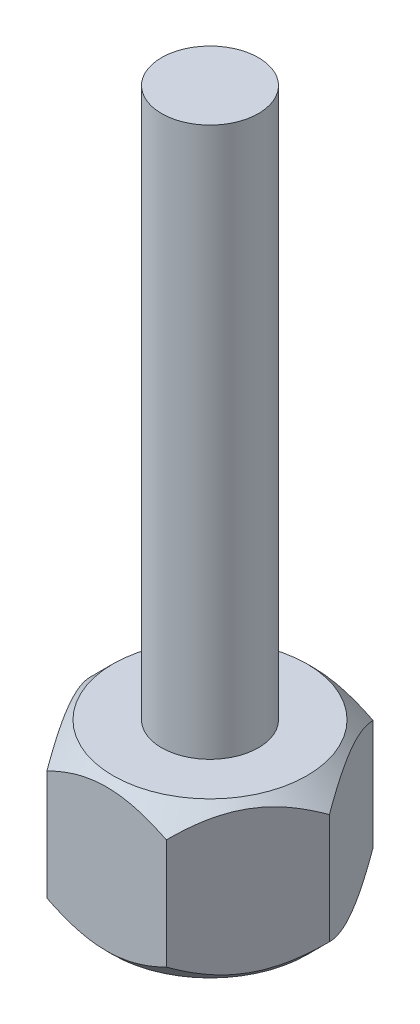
from build123d import *

# Parameters (mm, degrees)
BOSS_EXTRUDE1_DEPTH = 3
SKETCH2_OUTSIDE_W   = 25.96
SKETCH2_OUTSIDE_H   = 24.722
SKETCH2_OUTSIDE_R   = 3.75
CUT_EXTRUDE1_DEPTH  = 6
CUT_EXTRUDE1_DRAFT  = -45
SKETCH3_OUTSIDE_W   = 25.96
SKETCH3_OUTSIDE_H   = 24.722
SKETCH3_OUTSIDE_R   = 3.75
CUT_EXTRUDE2_DEPTH  = 6
CUT_EXTRUDE2_DRAFT  = -45
SKETCH4_R           = 1.875
BOSS_EXTRUDE2_DEPTH = 21.25


with BuildPart() as part:
    # Sketch1 → Boss-Extrude1 (new, symmetric)
    with BuildSketch(Plane(origin=(0, 0, 0), x_dir=(1, 0, 0), z_dir=(0, 1, 0))):
        Polygon((4.618802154, 0), (2.309401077, 4), (-2.309401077, 4), (-4.618802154, 0), (-2.309401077, -4), (2.309401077, -4), align=None)
    extrude(amount=BOSS_EXTRUDE1_DEPTH, both=True)


with BuildPart() as cut_extrude1_tool:
    # Sketch2 outside → Cut-Extrude1 (with draft: the straight prism first)
    with BuildSketch(Plane(origin=(0, 3, 0), x_dir=(1, 0, 0), z_dir=(0, 1, 0))):
        Rectangle(SKETCH2_OUTSIDE_W, SKETCH2_OUTSIDE_H)
        Circle(SKETCH2_OUTSIDE_R, mode=Mode.SUBTRACT)
    extrude(amount=-CUT_EXTRUDE1_DEPTH)
    # Cut-Extrude1: the draft: its side faces are tilted about the plane it starts from
    cut_extrude1_sides = [cut_extrude1_tool.faces().sort_by_distance(p)[0] for p in [
        (0, 0, 12.361),
        (12.98, 0, 0),
        (0, 0, -12.361),
        (-12.98, 0, 0),
        (-3.75, 0, 0),
    ]]
    draft(cut_extrude1_sides, Plane(origin=(0, 3, 0), x_dir=(1, 0, 0), z_dir=(0, 1, 0)), CUT_EXTRUDE1_DRAFT)


with BuildPart() as part_1:
    add(part.part)

    # Cut-Extrude1: cut by cut_extrude1_tool
    add(cut_extrude1_tool.part, mode=Mode.SUBTRACT)


with BuildPart() as cut_extrude2_tool:
    # Sketch3 outside → Cut-Extrude2 (with draft: the straight prism first)
    with BuildSketch(Plane.XZ.offset(3)):
        Rectangle(SKETCH3_OUTSIDE_W, SKETCH3_OUTSIDE_H)
        Circle(SKETCH3_OUTSIDE_R, mode=Mode.SUBTRACT)
    extrude(amount=-CUT_EXTRUDE2_DEPTH)
    # Cut-Extrude2: the draft: its side faces are tilted about the plane it starts from
    cut_extrude2_sides = [cut_extrude2_tool.faces().sort_by_distance(p)[0] for p in [
        (0, 0, -12.361),
        (12.98, 0, 0),
        (0, 0, 12.361),
        (-12.98, 0, 0),
        (-3.75, 0, 0),
    ]]
    draft(cut_extrude2_sides, Plane.XZ.offset(3), CUT_EXTRUDE2_DRAFT)


with BuildPart() as part_2:
    add(part_1.part)

    # Cut-Extrude2: cut by cut_extrude2_tool
    add(cut_extrude2_tool.part, mode=Mode.SUBTRACT)

    # Sketch4 → Boss-Extrude2 (add)
    with BuildSketch(Plane(origin=(0, 3, 0), x_dir=(1, 0, 0), z_dir=(0, 1, 0))):
        with Locations(Location((0, 0, 0), (0, 0, 270))):
            Circle(SKETCH4_R)
    extrude(amount=BOSS_EXTRUDE2_DEPTH)


solid = part_2.part
